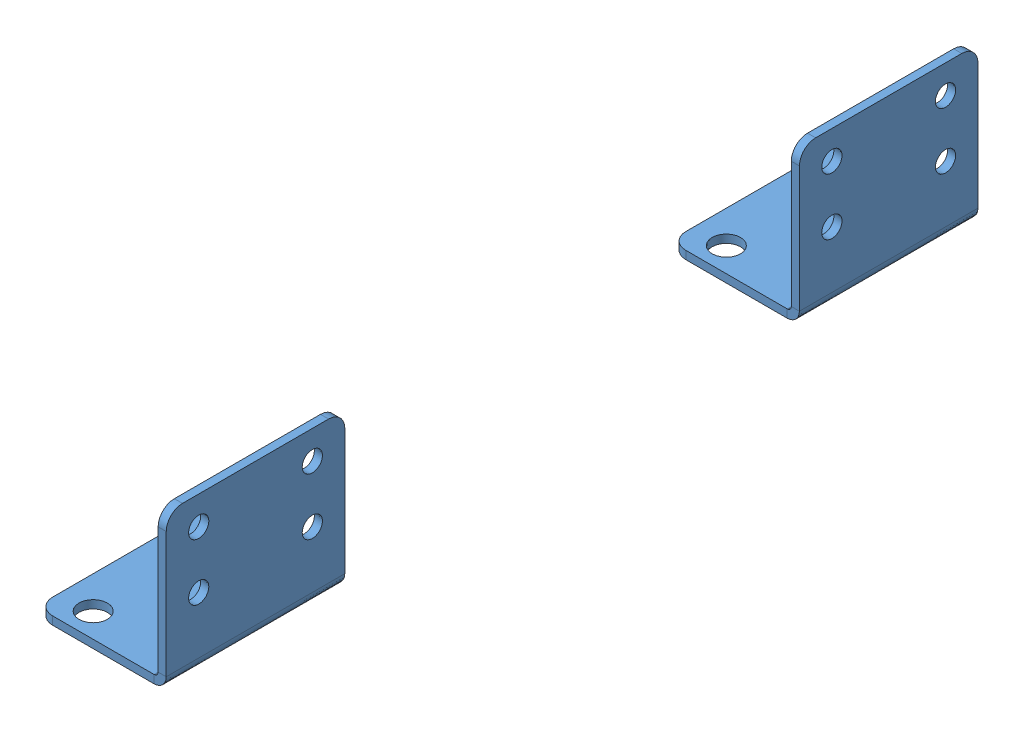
SolidWorks assembly 极限轨道与开关固定座组合.SLDASM, configuration 150 (file format 13000). Lengths in mm.
Overall size (16 19 100).
3 component instances, 2 part files, 6 mates.
Components (placement in the parent):
- SFKK60-LR 极限轨道-1: SFKK60-LR 极限轨道.SLDPRT [150] at (-2.8111 1.1304 150) (suppressed, hidden)
- 开关固定座：KK-674S2-F-1: 开关固定座：KK-674S2-F.SLDPRT [默认] at (8.1889 4.6304 189) x (0 1 0) z (0 0 1) size (19 16 22)
- 开关固定座：KK-674S2-F-2: 开关固定座：KK-674S2-F.SLDPRT [默认] at (8.1889 4.6304 111) x (0 1 0) z (0 0 1) size (19 16 22)
Mates (geometry in assembly coordinates):
- 重合1: coincident: plane of assembly; plane of SFKK60-LR 极限轨道-1 through (-6.8111 3.6304 225) normal (0 1 0); plane of 开关固定座：KK-674S2-F-1 through (-6.8111 3.6304 200) normal (0 -1 0)
- 距离1: distance = 25 mm aligned: plane of 开关固定座：KK-674S2-F-1 through (7.6889 5.1304 200) normal (0 0 1); plane of SFKK60-LR 极限轨道-1 through (-2.8111 1.1304 225) normal (0 0 1)
- 重合3: coincident: plane of assembly; plane of SFKK60-LR 极限轨道-1 through (-6.8111 -1.3696 225) normal (-1 0 0); plane of 开关固定座：KK-674S2-F-1 through (-6.8111 3.6304 200) normal (-1 0 0)
- 重合4: coincident aligned: plane of 开关固定座：KK-674S2-F-1 through (-6.8111 4.6304 200) normal (0 1 0); plane of 开关固定座：KK-674S2-F-2 through (-6.8111 4.6304 122) normal (0 1 0)
- 重合5: coincident aligned: plane of 开关固定座：KK-674S2-F-1 through (8.1889 4.6304 200) normal (-1 0 0); plane of 开关固定座：KK-674S2-F-2 through (8.1889 4.6304 122) normal (-1 0 0)
- 距离2: distance = 25 mm: plane of assembly; plane of SFKK60-LR 极限轨道-1 through (-2.8111 1.1304 75) normal (0 0 -1); plane of 开关固定座：KK-674S2-F-2 through (9.1889 5.1304 100) normal (0 0 -1)
